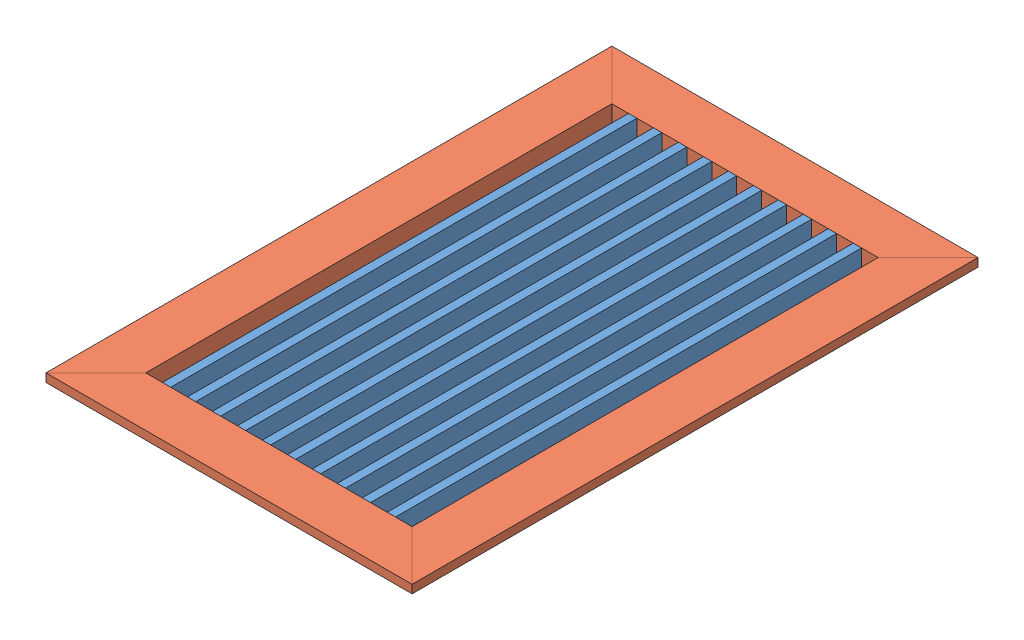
SolidWorks assembly 506(STEP 4) - Copy.SLDASM, configuration Default (file format 11000). Lengths in mm.
Overall size (139.7 19.05 215.9).
3 component instances, 3 part files, 6 mates.
Components (placement in the parent):
- Standard AG10 Core-1: Standard AG10 Core.SLDPRT [Default] at origin size (101.6 19.05 177.8)
- Standard AG10 B Frame-1: Standard AG10 B Frame.SLDPRT [Default] at (-26.9875 9.525 -88.9) size (139.7 19.05 215.9)
- WallorFloororWood-1: WallorFloororWood.SLDPRT [Default] at (42.8625 -9.525 -88.9) x (0 0 -1) z (1 0 0) (suppressed, hidden)
Mates (geometry in assembly coordinates):
- Coincident1: coincident: plane of assembly; plane of assembly; plane of Standard AG10 Core-1 through (-7.9375 0 0) normal (-1 0 0); plane of Standard AG10 B Frame-1 through (-7.9375 9.525 0) normal (1 0 0)
- Coincident2: coincident: plane of assembly; plane of assembly; plane of Standard AG10 Core-1 through (9.525 0 0) normal (0 0 1); plane of Standard AG10 B Frame-1 through (-26.9875 -134.6429 0) normal (0 0 -1)
- Coincident3: coincident: plane of assembly; plane of Standard AG10 Core-1 through (49.2125 9.525 -177.8) normal (0 1 0); plane of Standard AG10 B Frame-1 through (-26.9875 9.525 0) normal (0 1 0)
- Coincident4: coincident: plane of assembly; plane of assembly; plane of Standard AG10 B Frame-1 through (-11.1125 6.35 0) normal (-1 0 0); plane of WallorFloororWood-1 through (-11.1125 9.525 -180.975) normal (1 0 0)
- Coincident5: coincident: plane of assembly; plane of assembly; plane of Standard AG10 B Frame-1 through (-11.1125 -117.5217 -180.975) normal (0 0 -1); plane of WallorFloororWood-1 through (96.8375 9.525 -180.975) normal (0 0 1)
- Coincident6: coincident: plane of assembly; plane of Standard AG10 B Frame-1 through (-26.9875 6.35 0) normal (0 -1 0); plane of WallorFloororWood-1 through (42.8625 6.35 -88.9) normal (0 1 0)
